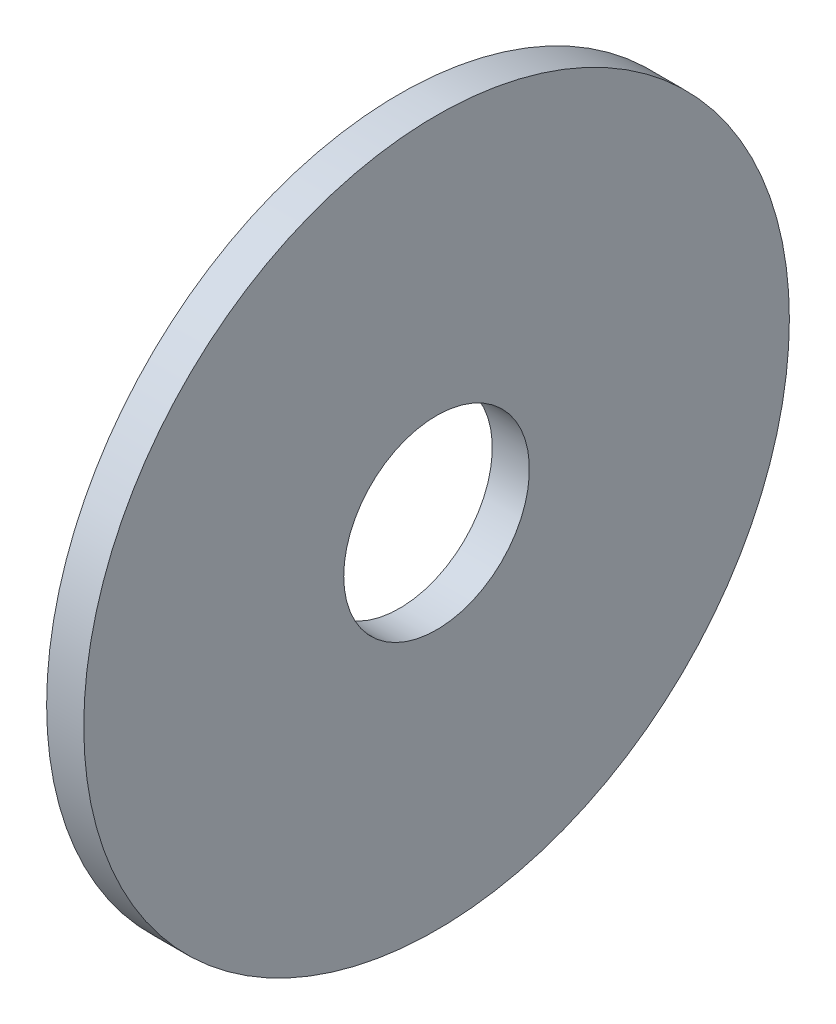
from build123d import *

# Parameters (mm, degrees)
ESQUISSE1_W = 3
ESQUISSE1_H = 21


with BuildPart() as part:
    # Esquisse1 → Base-R_volution (revolve)
    with BuildSketch(Plane(origin=(0, 0, 0), x_dir=(1, 0, 0), z_dir=(0, 1, 0)), mode=Mode.PRIVATE) as base_r_volution_sk:
        with Locations((1.5, 18)):
            Rectangle(ESQUISSE1_W, ESQUISSE1_H)
    revolve(base_r_volution_sk.sketch.rotate(Axis((0, 0, 0), (1, 0, 0)), 180), axis=Axis((0, 0, 0), (1, 0, 0)))


solid = part.part
